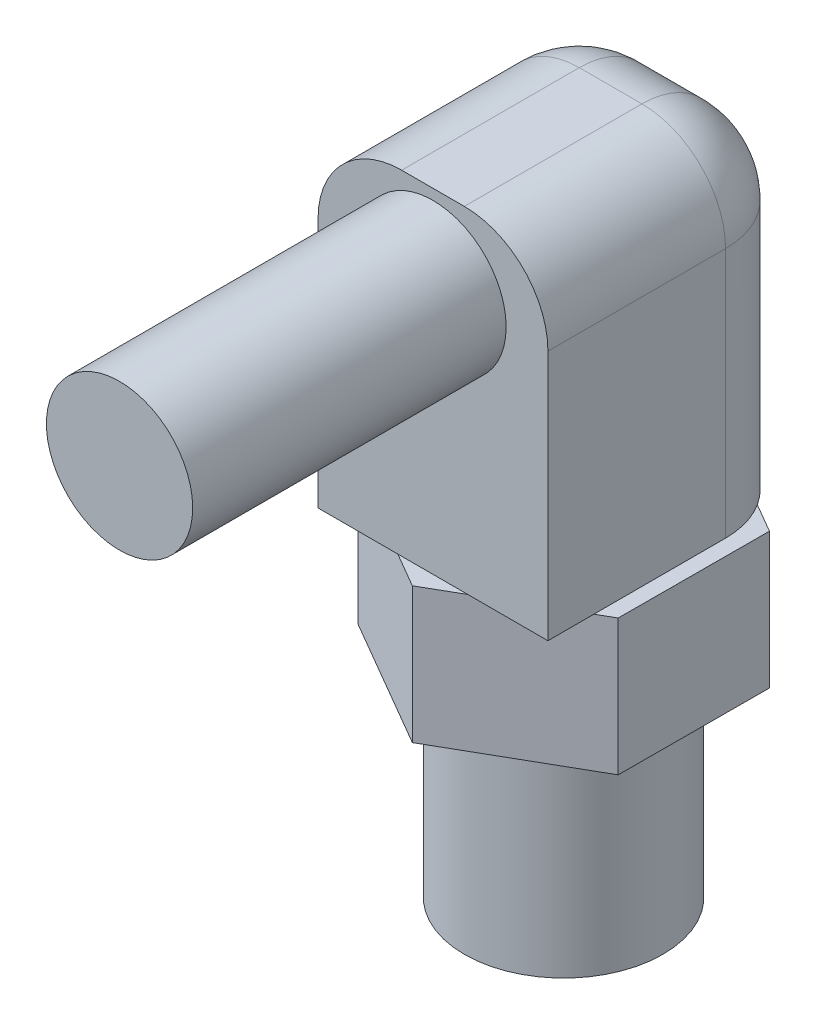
ISO-10303-21;
HEADER;
FILE_DESCRIPTION(('STEP AP214'),'2;1');
FILE_NAME('part.step','',(''),(''),'','','');
FILE_SCHEMA(('AUTOMOTIVE_DESIGN { 1 0 10303 214 1 1 1 1 }'));
ENDSEC;
DATA;
#1=APPLICATION_CONTEXT('core data for automotive mechanical design processes');
#2=APPLICATION_PROTOCOL_DEFINITION('international standard','automotive_design',2000,#1);
#3=PRODUCT_CONTEXT('',#1,'mechanical');
#4=PRODUCT('Part','Part','',(#3));
#5=PRODUCT_RELATED_PRODUCT_CATEGORY('part','',(#4));
#6=PRODUCT_DEFINITION_FORMATION('','',#4);
#7=PRODUCT_DEFINITION_CONTEXT('part definition',#1,'design');
#8=PRODUCT_DEFINITION('design','',#6,#7);
#9=PRODUCT_DEFINITION_SHAPE('','',#8);
#10=(LENGTH_UNIT() NAMED_UNIT(*) SI_UNIT(.MILLI.,.METRE.));
#11=(NAMED_UNIT(*) PLANE_ANGLE_UNIT() SI_UNIT($,.RADIAN.));
#12=(NAMED_UNIT(*) SI_UNIT($,.STERADIAN.) SOLID_ANGLE_UNIT());
#13=UNCERTAINTY_MEASURE_WITH_UNIT(LENGTH_MEASURE(1.E-05),#10,'distance_accuracy_value','');
#14=(GEOMETRIC_REPRESENTATION_CONTEXT(3) GLOBAL_UNCERTAINTY_ASSIGNED_CONTEXT((#13)) GLOBAL_UNIT_ASSIGNED_CONTEXT((#10,
#11,#12)) REPRESENTATION_CONTEXT('',''));
#15=CARTESIAN_POINT('',(0.,0.,0.));
#16=DIRECTION('',(0.,0.,1.));
#17=DIRECTION('',(1.,0.,0.));
#18=AXIS2_PLACEMENT_3D('',#15,#16,#17);
#19=CARTESIAN_POINT('',(-0.0105994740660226,-7.36600000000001,6.84115888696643));
#20=DIRECTION('',(0.,1.,0.));
#21=DIRECTION('',(0.,0.,1.));
#22=AXIS2_PLACEMENT_3D('',#19,#20,#21);
#23=PLANE('',#22);
#24=DIRECTION('',(-0.864576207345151,0.,-0.50250172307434));
#25=VECTOR('',#24,1.);
#26=CARTESIAN_POINT('',(-0.0105994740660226,-7.36600000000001,6.84115888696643));
#27=LINE('',#26,#25);
#28=CARTESIAN_POINT('',(-0.0105994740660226,-7.36600000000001,6.84115888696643));
#29=VERTEX_POINT('',#28);
#30=CARTESIAN_POINT('',(-3.18028646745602,-7.36600000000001,4.99890002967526));
#31=VERTEX_POINT('',#30);
#32=EDGE_CURVE('E169',#29,#31,#27,.T.);
#33=ORIENTED_EDGE('',*,*,#32,.T.);
#34=DIRECTION('',(0.00289115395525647,0.,-0.999995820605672));
#35=VECTOR('',#34,1.);
#36=CARTESIAN_POINT('',(-3.18028646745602,-7.36600000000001,4.99890002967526));
#37=LINE('',#36,#35);
#38=CARTESIAN_POINT('',(-3.16968699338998,-7.36600000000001,1.33274114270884));
#39=VERTEX_POINT('',#38);
#40=EDGE_CURVE('E158',#31,#39,#37,.T.);
#41=ORIENTED_EDGE('',*,*,#40,.T.);
#42=DIRECTION('',(0.867467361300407,0.,-0.497494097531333));
#43=VECTOR('',#42,1.);
#44=CARTESIAN_POINT('',(-3.16968699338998,-7.36600000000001,1.33274114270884));
#45=LINE('',#44,#43);
#46=CARTESIAN_POINT('',(0.0105994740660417,-7.36600000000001,-0.491158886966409));
#47=VERTEX_POINT('',#46);
#48=EDGE_CURVE('E168',#39,#47,#45,.T.);
#49=ORIENTED_EDGE('',*,*,#48,.T.);
#50=DIRECTION('',(0.864576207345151,0.,0.50250172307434));
#51=VECTOR('',#50,1.);
#52=CARTESIAN_POINT('',(0.0105994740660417,-7.36600000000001,-0.491158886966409));
#53=LINE('',#52,#51);
#54=CARTESIAN_POINT('',(3.18028646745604,-7.36600000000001,1.35109997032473));
#55=VERTEX_POINT('',#54);
#56=EDGE_CURVE('E579',#47,#55,#53,.T.);
#57=ORIENTED_EDGE('',*,*,#56,.T.);
#58=DIRECTION('',(-0.00289115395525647,0.,0.999995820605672));
#59=VECTOR('',#58,1.);
#60=CARTESIAN_POINT('',(3.18028646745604,-7.36600000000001,1.35109997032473));
#61=LINE('',#60,#59);
#62=CARTESIAN_POINT('',(3.16968699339,-7.36600000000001,5.01725885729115));
#63=VERTEX_POINT('',#62);
#64=EDGE_CURVE('E577',#55,#63,#61,.T.);
#65=ORIENTED_EDGE('',*,*,#64,.T.);
#66=DIRECTION('',(-0.867467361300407,0.,0.497494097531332));
#67=VECTOR('',#66,1.);
#68=CARTESIAN_POINT('',(3.16968699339,-7.36600000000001,5.01725885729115));
#69=LINE('',#68,#67);
#70=EDGE_CURVE('E174',#63,#29,#69,.T.);
#71=ORIENTED_EDGE('',*,*,#70,.T.);
#72=EDGE_LOOP('',(#33,#41,#49,#57,#65,#71));
#73=FACE_BOUND('',#72,.T.);
#74=CARTESIAN_POINT('',(0.,-7.36600000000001,3.17500000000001));
#75=DIRECTION('',(0.,1.,0.));
#76=DIRECTION('',(0.,0.,1.));
#77=AXIS2_PLACEMENT_3D('',#74,#75,#76);
#78=CIRCLE('',#77,2.413);
#79=CARTESIAN_POINT('',(0.,-7.36600000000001,5.58800000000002));
#80=VERTEX_POINT('',#79);
#81=EDGE_CURVE('E221',#80,#80,#78,.F.);
#82=ORIENTED_EDGE('',*,*,#81,.F.);
#83=EDGE_LOOP('',(#82));
#84=FACE_BOUND('',#83,.T.);
#85=ADVANCED_FACE('F32',(#73,#84),#23,.F.);
#86=CARTESIAN_POINT('',(-2.794,-4.06400000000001,6.34999999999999));
#87=DIRECTION('',(0.,1.,0.));
#88=DIRECTION('',(0.,0.,1.));
#89=AXIS2_PLACEMENT_3D('',#86,#87,#88);
#90=PLANE('',#89);
#91=DIRECTION('',(-0.864576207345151,0.,-0.50250172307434));
#92=VECTOR('',#91,1.);
#93=CARTESIAN_POINT('',(-0.0105994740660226,-4.06400000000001,6.84115888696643));
#94=LINE('',#93,#92);
#95=CARTESIAN_POINT('',(-0.855659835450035,-4.06400000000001,6.34999999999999));
#96=VERTEX_POINT('',#95);
#97=CARTESIAN_POINT('',(-2.794,-4.06400000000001,5.22341420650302));
#98=VERTEX_POINT('',#97);
#99=EDGE_CURVE('E225',#96,#98,#94,.T.);
#100=ORIENTED_EDGE('',*,*,#99,.F.);
#101=DIRECTION('',(1.,0.,0.));
#102=VECTOR('',#101,1.);
#103=CARTESIAN_POINT('',(-2.794,-4.06400000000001,6.34999999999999));
#104=LINE('',#103,#102);
#105=CARTESIAN_POINT('',(-2.794,-4.06400000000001,6.34999999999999));
#106=VERTEX_POINT('',#105);
#107=EDGE_CURVE('E207',#106,#96,#104,.T.);
#108=ORIENTED_EDGE('',*,*,#107,.F.);
#109=DIRECTION('',(0.,0.,-1.));
#110=VECTOR('',#109,1.);
#111=CARTESIAN_POINT('',(-2.794,-4.06400000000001,6.34999999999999));
#112=LINE('',#111,#110);
#113=EDGE_CURVE('E217',#106,#98,#112,.T.);
#114=ORIENTED_EDGE('',*,*,#113,.T.);
#115=EDGE_LOOP('',(#100,#108,#114));
#116=FACE_BOUND('',#115,.T.);
#117=ADVANCED_FACE('F380',(#116),#90,.F.);
#118=DIRECTION('',(-0.867467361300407,0.,0.497494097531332));
#119=VECTOR('',#118,1.);
#120=CARTESIAN_POINT('',(3.16968699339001,-4.06400000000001,5.01725885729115));
#121=LINE('',#120,#119);
#122=CARTESIAN_POINT('',(2.79400000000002,-4.06400000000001,5.23271602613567));
#123=VERTEX_POINT('',#122);
#124=CARTESIAN_POINT('',(0.845821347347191,-4.06400000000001,6.34999999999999));
#125=VERTEX_POINT('',#124);
#126=EDGE_CURVE('E336',#123,#125,#121,.T.);
#127=ORIENTED_EDGE('',*,*,#126,.F.);
#128=DIRECTION('',(0.,0.,-1.));
#129=VECTOR('',#128,1.);
#130=CARTESIAN_POINT('',(2.79400000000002,-4.06400000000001,6.34999999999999));
#131=LINE('',#130,#129);
#132=CARTESIAN_POINT('',(2.79400000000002,-4.06400000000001,6.34999999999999));
#133=VERTEX_POINT('',#132);
#134=EDGE_CURVE('E213',#133,#123,#131,.T.);
#135=ORIENTED_EDGE('',*,*,#134,.F.);
#136=EDGE_CURVE('E206',#125,#133,#104,.T.);
#137=ORIENTED_EDGE('',*,*,#136,.F.);
#138=EDGE_LOOP('',(#127,#135,#137));
#139=FACE_BOUND('',#138,.T.);
#140=ADVANCED_FACE('F334',(#139),#90,.F.);
#141=DIRECTION('',(0.864576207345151,0.,0.50250172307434));
#142=VECTOR('',#141,1.);
#143=CARTESIAN_POINT('',(0.0105994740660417,-4.06400000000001,-0.491158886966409));
#144=LINE('',#143,#142);
#145=CARTESIAN_POINT('',(0.859703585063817,-4.06400000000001,0.00235027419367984));
#146=VERTEX_POINT('',#145);
#147=CARTESIAN_POINT('',(2.47720512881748,-4.06400000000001,0.942460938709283));
#148=VERTEX_POINT('',#147);
#149=EDGE_CURVE('E356',#146,#148,#144,.T.);
#150=ORIENTED_EDGE('',*,*,#149,.F.);
#151=CARTESIAN_POINT('',(0.76200000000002,-4.06400000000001,2.03200000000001));
#152=DIRECTION('',(0.,1.,0.));
#153=DIRECTION('',(0.,0.,1.));
#154=AXIS2_PLACEMENT_3D('',#151,#152,#153);
#155=CIRCLE('',#154,2.032);
#156=EDGE_CURVE('E266',#146,#148,#155,.F.);
#157=ORIENTED_EDGE('',*,*,#156,.T.);
#158=EDGE_LOOP('',(#150,#157));
#159=FACE_BOUND('',#158,.T.);
#160=ADVANCED_FACE('F378',(#159),#90,.F.);
#161=DIRECTION('',(0.867467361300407,0.,-0.497494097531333));
#162=VECTOR('',#161,1.);
#163=CARTESIAN_POINT('',(-3.16968699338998,-4.06400000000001,1.33274114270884));
#164=LINE('',#163,#162);
#165=CARTESIAN_POINT('',(-2.4702750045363,-4.06400000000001,0.931627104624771));
#166=VERTEX_POINT('',#165);
#167=CARTESIAN_POINT('',(-0.849076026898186,-4.06400000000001,0.00186656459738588));
#168=VERTEX_POINT('',#167);
#169=EDGE_CURVE('E220',#166,#168,#164,.T.);
#170=ORIENTED_EDGE('',*,*,#169,.F.);
#171=CARTESIAN_POINT('',(-0.76199999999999,-4.06400000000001,2.03200000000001));
#172=DIRECTION('',(0.,1.,0.));
#173=DIRECTION('',(0.,0.,1.));
#174=AXIS2_PLACEMENT_3D('',#171,#172,#173);
#175=CIRCLE('',#174,2.032);
#176=EDGE_CURVE('E257',#166,#168,#175,.F.);
#177=ORIENTED_EDGE('',*,*,#176,.T.);
#178=EDGE_LOOP('',(#170,#177));
#179=FACE_BOUND('',#178,.T.);
#180=ADVANCED_FACE('F376',(#179),#90,.F.);
#181=CARTESIAN_POINT('',(2.79400000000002,-4.06400000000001,6.34999999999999));
#182=DIRECTION('',(0.,0.,1.));
#183=DIRECTION('',(1.,0.,0.));
#184=AXIS2_PLACEMENT_3D('',#181,#182,#183);
#185=PLANE('',#184);
#186=DIRECTION('',(-1.,0.,0.));
#187=VECTOR('',#186,1.);
#188=CARTESIAN_POINT('',(-2.794,4.06400000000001,6.34999999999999));
#189=LINE('',#188,#187);
#190=CARTESIAN_POINT('',(0.762000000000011,4.06400000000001,6.34999999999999));
#191=VERTEX_POINT('',#190);
#192=CARTESIAN_POINT('',(-0.761999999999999,4.06400000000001,6.34999999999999));
#193=VERTEX_POINT('',#192);
#194=EDGE_CURVE('E201',#191,#193,#189,.T.);
#195=ORIENTED_EDGE('',*,*,#194,.T.);
#196=CARTESIAN_POINT('',(-0.761999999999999,2.03200000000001,6.34999999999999));
#197=DIRECTION('',(0.,0.,1.));
#198=DIRECTION('',(1.,0.,0.));
#199=AXIS2_PLACEMENT_3D('',#196,#197,#198);
#200=CIRCLE('',#199,2.032);
#201=CARTESIAN_POINT('',(-2.794,2.03200000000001,6.34999999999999));
#202=VERTEX_POINT('',#201);
#203=EDGE_CURVE('E238',#193,#202,#200,.T.);
#204=ORIENTED_EDGE('',*,*,#203,.T.);
#205=DIRECTION('',(0.,-1.,0.));
#206=VECTOR('',#205,1.);
#207=CARTESIAN_POINT('',(-2.794,4.06400000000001,6.34999999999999));
#208=LINE('',#207,#206);
#209=EDGE_CURVE('E204',#202,#106,#208,.T.);
#210=ORIENTED_EDGE('',*,*,#209,.T.);
#211=ORIENTED_EDGE('',*,*,#107,.T.);
#212=EDGE_CURVE('E211',#96,#125,#104,.T.);
#213=ORIENTED_EDGE('',*,*,#212,.T.);
#214=ORIENTED_EDGE('',*,*,#136,.T.);
#215=DIRECTION('',(0.,1.,0.));
#216=VECTOR('',#215,1.);
#217=CARTESIAN_POINT('',(2.79400000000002,4.06400000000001,6.34999999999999));
#218=LINE('',#217,#216);
#219=CARTESIAN_POINT('',(2.79400000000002,2.03200000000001,6.34999999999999));
#220=VERTEX_POINT('',#219);
#221=EDGE_CURVE('E198',#133,#220,#218,.T.);
#222=ORIENTED_EDGE('',*,*,#221,.T.);
#223=CARTESIAN_POINT('',(0.76200000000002,2.03200000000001,6.34999999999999));
#224=DIRECTION('',(0.,0.,1.));
#225=DIRECTION('',(1.,0.,0.));
#226=AXIS2_PLACEMENT_3D('',#223,#224,#225);
#227=CIRCLE('',#226,2.032);
#228=EDGE_CURVE('E236',#220,#191,#227,.T.);
#229=ORIENTED_EDGE('',*,*,#228,.T.);
#230=EDGE_LOOP('',(#195,#204,#210,#211,#213,#214,#222,#229));
#231=FACE_BOUND('',#230,.T.);
#232=CARTESIAN_POINT('',(0.,2.03200000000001,6.34999999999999));
#233=DIRECTION('',(0.,0.,1.));
#234=DIRECTION('',(1.,0.,0.));
#235=AXIS2_PLACEMENT_3D('',#232,#233,#234);
#236=CIRCLE('',#235,1.778);
#237=CARTESIAN_POINT('',(1.77800000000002,2.03200000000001,6.34999999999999));
#238=VERTEX_POINT('',#237);
#239=EDGE_CURVE('E186',#238,#238,#236,.T.);
#240=ORIENTED_EDGE('',*,*,#239,.F.);
#241=EDGE_LOOP('',(#240));
#242=FACE_BOUND('',#241,.T.);
#243=ADVANCED_FACE('F315',(#231,#242),#185,.T.);
#244=CARTESIAN_POINT('',(2.79400000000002,4.06400000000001,6.34999999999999));
#245=DIRECTION('',(-1.,0.,0.));
#246=DIRECTION('',(0.,0.,1.));
#247=AXIS2_PLACEMENT_3D('',#244,#245,#246);
#248=PLANE('',#247);
#249=CARTESIAN_POINT('',(2.79400000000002,-4.06400000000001,2.03200000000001));
#250=VERTEX_POINT('',#249);
#251=EDGE_CURVE('E210',#123,#250,#131,.T.);
#252=ORIENTED_EDGE('',*,*,#251,.T.);
#253=DIRECTION('',(0.,1.,0.));
#254=VECTOR('',#253,1.);
#255=CARTESIAN_POINT('',(2.79400000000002,4.06400000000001,2.03200000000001));
#256=LINE('',#255,#254);
#257=CARTESIAN_POINT('',(2.79400000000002,2.03200000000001,2.03200000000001));
#258=VERTEX_POINT('',#257);
#259=EDGE_CURVE('E264',#250,#258,#256,.T.);
#260=ORIENTED_EDGE('',*,*,#259,.T.);
#261=DIRECTION('',(0.,0.,-1.));
#262=VECTOR('',#261,1.);
#263=CARTESIAN_POINT('',(2.79400000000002,2.03200000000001,6.34999999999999));
#264=LINE('',#263,#262);
#265=EDGE_CURVE('E243',#258,#220,#264,.F.);
#266=ORIENTED_EDGE('',*,*,#265,.T.);
#267=ORIENTED_EDGE('',*,*,#221,.F.);
#268=ORIENTED_EDGE('',*,*,#134,.T.);
#269=EDGE_LOOP('',(#252,#260,#266,#267,#268));
#270=FACE_BOUND('',#269,.T.);
#271=ADVANCED_FACE('F330',(#270),#248,.F.);
#272=CARTESIAN_POINT('',(-2.794,4.06400000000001,6.34999999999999));
#273=DIRECTION('',(0.,-1.,0.));
#274=DIRECTION('',(0.,0.,-1.));
#275=AXIS2_PLACEMENT_3D('',#272,#273,#274);
#276=PLANE('',#275);
#277=DIRECTION('',(-1.,0.,0.));
#278=VECTOR('',#277,1.);
#279=CARTESIAN_POINT('',(-2.794,4.06400000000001,2.03200000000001));
#280=LINE('',#279,#278);
#281=CARTESIAN_POINT('',(0.762000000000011,4.06400000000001,2.03200000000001));
#282=VERTEX_POINT('',#281);
#283=CARTESIAN_POINT('',(-0.761999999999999,4.06400000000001,2.03200000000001));
#284=VERTEX_POINT('',#283);
#285=EDGE_CURVE('E231',#282,#284,#280,.T.);
#286=ORIENTED_EDGE('',*,*,#285,.T.);
#287=DIRECTION('',(0.,0.,-1.));
#288=VECTOR('',#287,1.);
#289=CARTESIAN_POINT('',(-0.761999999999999,4.06400000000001,6.34999999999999));
#290=LINE('',#289,#288);
#291=EDGE_CURVE('E234',#284,#193,#290,.F.);
#292=ORIENTED_EDGE('',*,*,#291,.T.);
#293=ORIENTED_EDGE('',*,*,#194,.F.);
#294=DIRECTION('',(0.,0.,-1.));
#295=VECTOR('',#294,1.);
#296=CARTESIAN_POINT('',(0.762000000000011,4.06400000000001,6.34999999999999));
#297=LINE('',#296,#295);
#298=EDGE_CURVE('E228',#191,#282,#297,.T.);
#299=ORIENTED_EDGE('',*,*,#298,.T.);
#300=EDGE_LOOP('',(#286,#292,#293,#299));
#301=FACE_BOUND('',#300,.T.);
#302=ADVANCED_FACE('F323',(#301),#276,.F.);
#303=CARTESIAN_POINT('',(-2.794,4.06400000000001,6.34999999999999));
#304=DIRECTION('',(1.,0.,0.));
#305=DIRECTION('',(0.,0.,-1.));
#306=AXIS2_PLACEMENT_3D('',#303,#304,#305);
#307=PLANE('',#306);
#308=DIRECTION('',(0.,0.,-1.));
#309=VECTOR('',#308,1.);
#310=CARTESIAN_POINT('',(-2.794,2.03200000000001,6.34999999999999));
#311=LINE('',#310,#309);
#312=CARTESIAN_POINT('',(-2.794,2.03200000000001,2.03200000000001));
#313=VERTEX_POINT('',#312);
#314=EDGE_CURVE('E224',#202,#313,#311,.T.);
#315=ORIENTED_EDGE('',*,*,#314,.T.);
#316=DIRECTION('',(0.,-1.,0.));
#317=VECTOR('',#316,1.);
#318=CARTESIAN_POINT('',(-2.794,4.06400000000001,2.03200000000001));
#319=LINE('',#318,#317);
#320=CARTESIAN_POINT('',(-2.794,-4.06400000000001,2.03200000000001));
#321=VERTEX_POINT('',#320);
#322=EDGE_CURVE('E255',#313,#321,#319,.T.);
#323=ORIENTED_EDGE('',*,*,#322,.T.);
#324=EDGE_CURVE('E216',#98,#321,#112,.T.);
#325=ORIENTED_EDGE('',*,*,#324,.F.);
#326=ORIENTED_EDGE('',*,*,#113,.F.);
#327=ORIENTED_EDGE('',*,*,#209,.F.);
#328=EDGE_LOOP('',(#315,#323,#325,#326,#327));
#329=FACE_BOUND('',#328,.T.);
#330=ADVANCED_FACE('F311',(#329),#307,.F.);
#331=CARTESIAN_POINT('',(2.79400000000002,-4.06400000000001,0.));
#332=DIRECTION('',(0.,0.,1.));
#333=DIRECTION('',(1.,0.,0.));
#334=AXIS2_PLACEMENT_3D('',#331,#332,#333);
#335=PLANE('',#334);
#336=DIRECTION('',(1.,0.,0.));
#337=VECTOR('',#336,1.);
#338=CARTESIAN_POINT('',(-2.794,-4.06400000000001,0.));
#339=LINE('',#338,#337);
#340=CARTESIAN_POINT('',(-0.76199999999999,-4.06400000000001,0.));
#341=VERTEX_POINT('',#340);
#342=CARTESIAN_POINT('',(0.76200000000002,-4.06400000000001,0.));
#343=VERTEX_POINT('',#342);
#344=EDGE_CURVE('E196',#341,#343,#339,.T.);
#345=ORIENTED_EDGE('',*,*,#344,.F.);
#346=DIRECTION('',(0.,-1.,0.));
#347=VECTOR('',#346,1.);
#348=CARTESIAN_POINT('',(-0.76199999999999,-4.06400000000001,0.));
#349=LINE('',#348,#347);
#350=CARTESIAN_POINT('',(-0.761999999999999,2.03200000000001,0.));
#351=VERTEX_POINT('',#350);
#352=EDGE_CURVE('E262',#341,#351,#349,.F.);
#353=ORIENTED_EDGE('',*,*,#352,.T.);
#354=DIRECTION('',(-1.,0.,0.));
#355=VECTOR('',#354,1.);
#356=CARTESIAN_POINT('',(2.79400000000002,2.03200000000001,0.));
#357=LINE('',#356,#355);
#358=CARTESIAN_POINT('',(0.76200000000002,2.03200000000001,0.));
#359=VERTEX_POINT('',#358);
#360=EDGE_CURVE('E240',#351,#359,#357,.F.);
#361=ORIENTED_EDGE('',*,*,#360,.T.);
#362=DIRECTION('',(0.,1.,0.));
#363=VECTOR('',#362,1.);
#364=CARTESIAN_POINT('',(0.76200000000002,-4.06400000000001,0.));
#365=LINE('',#364,#363);
#366=EDGE_CURVE('E260',#359,#343,#365,.F.);
#367=ORIENTED_EDGE('',*,*,#366,.T.);
#368=EDGE_LOOP('',(#345,#353,#361,#367));
#369=FACE_BOUND('',#368,.T.);
#370=ADVANCED_FACE('F296',(#369),#335,.F.);
#371=CARTESIAN_POINT('',(0.,2.03200000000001,13.97));
#372=DIRECTION('',(0.,0.,-1.));
#373=DIRECTION('',(-1.,0.,0.));
#374=AXIS2_PLACEMENT_3D('',#371,#372,#373);
#375=CYLINDRICAL_SURFACE('',#374,1.778);
#376=CARTESIAN_POINT('',(0.,2.03200000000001,13.97));
#377=DIRECTION('',(0.,0.,1.));
#378=DIRECTION('',(1.,0.,0.));
#379=AXIS2_PLACEMENT_3D('',#376,#377,#378);
#380=CIRCLE('',#379,1.778);
#381=CARTESIAN_POINT('',(1.77800000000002,2.03200000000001,13.97));
#382=VERTEX_POINT('',#381);
#383=EDGE_CURVE('E189',#382,#382,#380,.T.);
#384=ORIENTED_EDGE('',*,*,#383,.F.);
#385=EDGE_LOOP('',(#384));
#386=FACE_BOUND('',#385,.T.);
#387=ORIENTED_EDGE('',*,*,#239,.T.);
#388=EDGE_LOOP('',(#387));
#389=FACE_BOUND('',#388,.T.);
#390=ADVANCED_FACE('F422',(#386,#389),#375,.T.);
#391=CARTESIAN_POINT('',(0.,2.03200000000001,13.97));
#392=DIRECTION('',(0.,0.,1.));
#393=DIRECTION('',(1.,0.,0.));
#394=AXIS2_PLACEMENT_3D('',#391,#392,#393);
#395=PLANE('',#394);
#396=ORIENTED_EDGE('',*,*,#383,.T.);
#397=EDGE_LOOP('',(#396));
#398=FACE_BOUND('',#397,.T.);
#399=ADVANCED_FACE('F419',(#398),#395,.T.);
#400=CARTESIAN_POINT('',(-0.0105994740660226,-4.06400000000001,6.84115888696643));
#401=DIRECTION('',(0.,1.,0.));
#402=DIRECTION('',(0.,0.,1.));
#403=AXIS2_PLACEMENT_3D('',#400,#401,#402);
#404=PLANE('',#403);
#405=ORIENTED_EDGE('',*,*,#251,.F.);
#406=CARTESIAN_POINT('',(3.16968699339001,-4.06400000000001,5.01725885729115));
#407=VERTEX_POINT('',#406);
#408=EDGE_CURVE('E178',#407,#123,#121,.T.);
#409=ORIENTED_EDGE('',*,*,#408,.F.);
#410=DIRECTION('',(-0.00289115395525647,0.,0.999995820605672));
#411=VECTOR('',#410,1.);
#412=CARTESIAN_POINT('',(3.18028646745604,-4.06400000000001,1.35109997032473));
#413=LINE('',#412,#411);
#414=CARTESIAN_POINT('',(3.18028646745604,-4.06400000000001,1.35109997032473));
#415=VERTEX_POINT('',#414);
#416=EDGE_CURVE('E349',#415,#407,#413,.T.);
#417=ORIENTED_EDGE('',*,*,#416,.F.);
#418=EDGE_CURVE('E48',#148,#415,#144,.T.);
#419=ORIENTED_EDGE('',*,*,#418,.F.);
#420=CARTESIAN_POINT('',(0.76200000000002,-4.06400000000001,2.03200000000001));
#421=DIRECTION('',(0.,1.,0.));
#422=DIRECTION('',(0.,0.,1.));
#423=AXIS2_PLACEMENT_3D('',#420,#421,#422);
#424=CIRCLE('',#423,2.032);
#425=EDGE_CURVE('E11',#148,#250,#424,.F.);
#426=ORIENTED_EDGE('',*,*,#425,.T.);
#427=EDGE_LOOP('',(#405,#409,#417,#419,#426));
#428=FACE_BOUND('',#427,.T.);
#429=ADVANCED_FACE('F340',(#428),#404,.T.);
#430=ORIENTED_EDGE('',*,*,#212,.F.);
#431=CARTESIAN_POINT('',(-0.0105994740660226,-4.06400000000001,6.84115888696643));
#432=VERTEX_POINT('',#431);
#433=EDGE_CURVE('E354',#432,#96,#94,.T.);
#434=ORIENTED_EDGE('',*,*,#433,.F.);
#435=EDGE_CURVE('E347',#125,#432,#121,.T.);
#436=ORIENTED_EDGE('',*,*,#435,.F.);
#437=EDGE_LOOP('',(#430,#434,#436));
#438=FACE_BOUND('',#437,.T.);
#439=ADVANCED_FACE('F521',(#438),#404,.T.);
#440=CARTESIAN_POINT('',(0.0105994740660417,-4.06400000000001,-0.491158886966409));
#441=VERTEX_POINT('',#440);
#442=EDGE_CURVE('E363',#168,#441,#164,.T.);
#443=ORIENTED_EDGE('',*,*,#442,.F.);
#444=CARTESIAN_POINT('',(-0.76199999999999,-4.06400000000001,2.03200000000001));
#445=DIRECTION('',(0.,1.,0.));
#446=DIRECTION('',(0.,0.,1.));
#447=AXIS2_PLACEMENT_3D('',#444,#445,#446);
#448=CIRCLE('',#447,2.032);
#449=EDGE_CURVE('E270',#168,#341,#448,.F.);
#450=ORIENTED_EDGE('',*,*,#449,.T.);
#451=ORIENTED_EDGE('',*,*,#344,.T.);
#452=CARTESIAN_POINT('',(0.76200000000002,-4.06400000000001,2.03200000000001));
#453=DIRECTION('',(0.,1.,0.));
#454=DIRECTION('',(0.,0.,1.));
#455=AXIS2_PLACEMENT_3D('',#452,#453,#454);
#456=CIRCLE('',#455,2.032);
#457=EDGE_CURVE('E41',#343,#146,#456,.F.);
#458=ORIENTED_EDGE('',*,*,#457,.T.);
#459=EDGE_CURVE('E352',#441,#146,#144,.T.);
#460=ORIENTED_EDGE('',*,*,#459,.F.);
#461=EDGE_LOOP('',(#443,#450,#451,#458,#460));
#462=FACE_BOUND('',#461,.T.);
#463=ADVANCED_FACE('F403',(#462),#404,.T.);
#464=CARTESIAN_POINT('',(-0.0105994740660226,-7.36600000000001,6.84115888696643));
#465=DIRECTION('',(0.50250172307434,0.,-0.864576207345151));
#466=DIRECTION('',(-0.864576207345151,0.,-0.50250172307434));
#467=AXIS2_PLACEMENT_3D('',#464,#465,#466);
#468=PLANE('',#467);
#469=ORIENTED_EDGE('',*,*,#433,.T.);
#470=ORIENTED_EDGE('',*,*,#99,.T.);
#471=CARTESIAN_POINT('',(-3.18028646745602,-4.06400000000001,4.99890002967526));
#472=VERTEX_POINT('',#471);
#473=EDGE_CURVE('E184',#98,#472,#94,.T.);
#474=ORIENTED_EDGE('',*,*,#473,.T.);
#475=DIRECTION('',(0.,1.,0.));
#476=VECTOR('',#475,1.);
#477=CARTESIAN_POINT('',(-3.18028646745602,-7.36600000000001,4.99890002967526));
#478=LINE('',#477,#476);
#479=EDGE_CURVE('E163',#31,#472,#478,.T.);
#480=ORIENTED_EDGE('',*,*,#479,.F.);
#481=ORIENTED_EDGE('',*,*,#32,.F.);
#482=DIRECTION('',(0.,1.,0.));
#483=VECTOR('',#482,1.);
#484=CARTESIAN_POINT('',(-0.0105994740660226,-7.36600000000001,6.84115888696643));
#485=LINE('',#484,#483);
#486=EDGE_CURVE('E574',#29,#432,#485,.T.);
#487=ORIENTED_EDGE('',*,*,#486,.T.);
#488=EDGE_LOOP('',(#469,#470,#474,#480,#481,#487));
#489=FACE_BOUND('',#488,.T.);
#490=ADVANCED_FACE('F181',(#489),#468,.F.);
#491=CARTESIAN_POINT('',(-3.18028646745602,-7.36600000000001,4.99890002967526));
#492=DIRECTION('',(0.999995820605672,0.,0.00289115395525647));
#493=DIRECTION('',(0.00289115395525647,0.,-0.999995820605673));
#494=AXIS2_PLACEMENT_3D('',#491,#492,#493);
#495=PLANE('',#494);
#496=DIRECTION('',(0.00289115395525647,0.,-0.999995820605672));
#497=VECTOR('',#496,1.);
#498=CARTESIAN_POINT('',(-3.18028646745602,-4.06400000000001,4.99890002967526));
#499=LINE('',#498,#497);
#500=CARTESIAN_POINT('',(-3.16968699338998,-4.06400000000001,1.33274114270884));
#501=VERTEX_POINT('',#500);
#502=EDGE_CURVE('E367',#472,#501,#499,.T.);
#503=ORIENTED_EDGE('',*,*,#502,.T.);
#504=DIRECTION('',(0.,1.,0.));
#505=VECTOR('',#504,1.);
#506=CARTESIAN_POINT('',(-3.16968699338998,-7.36600000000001,1.33274114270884));
#507=LINE('',#506,#505);
#508=EDGE_CURVE('E165',#39,#501,#507,.T.);
#509=ORIENTED_EDGE('',*,*,#508,.F.);
#510=ORIENTED_EDGE('',*,*,#40,.F.);
#511=ORIENTED_EDGE('',*,*,#479,.T.);
#512=EDGE_LOOP('',(#503,#509,#510,#511));
#513=FACE_BOUND('',#512,.T.);
#514=ADVANCED_FACE('F161',(#513),#495,.F.);
#515=CARTESIAN_POINT('',(-3.16968699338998,-7.36600000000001,1.33274114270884));
#516=DIRECTION('',(0.497494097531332,0.,0.867467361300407));
#517=DIRECTION('',(0.867467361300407,0.,-0.497494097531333));
#518=AXIS2_PLACEMENT_3D('',#515,#516,#517);
#519=PLANE('',#518);
#520=ORIENTED_EDGE('',*,*,#508,.T.);
#521=EDGE_CURVE('E361',#501,#166,#164,.T.);
#522=ORIENTED_EDGE('',*,*,#521,.T.);
#523=ORIENTED_EDGE('',*,*,#169,.T.);
#524=ORIENTED_EDGE('',*,*,#442,.T.);
#525=DIRECTION('',(0.,1.,0.));
#526=VECTOR('',#525,1.);
#527=CARTESIAN_POINT('',(0.0105994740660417,-7.36600000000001,-0.491158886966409));
#528=LINE('',#527,#526);
#529=EDGE_CURVE('E191',#47,#441,#528,.T.);
#530=ORIENTED_EDGE('',*,*,#529,.F.);
#531=ORIENTED_EDGE('',*,*,#48,.F.);
#532=EDGE_LOOP('',(#520,#522,#523,#524,#530,#531));
#533=FACE_BOUND('',#532,.T.);
#534=ADVANCED_FACE('F374',(#533),#519,.F.);
#535=CARTESIAN_POINT('',(0.0105994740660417,-7.36600000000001,-0.491158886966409));
#536=DIRECTION('',(-0.50250172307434,0.,0.864576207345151));
#537=DIRECTION('',(0.864576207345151,0.,0.50250172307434));
#538=AXIS2_PLACEMENT_3D('',#535,#536,#537);
#539=PLANE('',#538);
#540=ORIENTED_EDGE('',*,*,#529,.T.);
#541=ORIENTED_EDGE('',*,*,#459,.T.);
#542=ORIENTED_EDGE('',*,*,#149,.T.);
#543=ORIENTED_EDGE('',*,*,#418,.T.);
#544=DIRECTION('',(0.,1.,0.));
#545=VECTOR('',#544,1.);
#546=CARTESIAN_POINT('',(3.18028646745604,-7.36600000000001,1.35109997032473));
#547=LINE('',#546,#545);
#548=EDGE_CURVE('E582',#55,#415,#547,.T.);
#549=ORIENTED_EDGE('',*,*,#548,.F.);
#550=ORIENTED_EDGE('',*,*,#56,.F.);
#551=EDGE_LOOP('',(#540,#541,#542,#543,#549,#550));
#552=FACE_BOUND('',#551,.T.);
#553=ADVANCED_FACE('F409',(#552),#539,.F.);
#554=CARTESIAN_POINT('',(3.18028646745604,-7.36600000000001,1.35109997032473));
#555=DIRECTION('',(-0.999995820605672,0.,-0.00289115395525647));
#556=DIRECTION('',(-0.00289115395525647,0.,0.999995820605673));
#557=AXIS2_PLACEMENT_3D('',#554,#555,#556);
#558=PLANE('',#557);
#559=ORIENTED_EDGE('',*,*,#416,.T.);
#560=DIRECTION('',(0.,1.,0.));
#561=VECTOR('',#560,1.);
#562=CARTESIAN_POINT('',(3.16968699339,-7.36600000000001,5.01725885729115));
#563=LINE('',#562,#561);
#564=EDGE_CURVE('E346',#63,#407,#563,.T.);
#565=ORIENTED_EDGE('',*,*,#564,.F.);
#566=ORIENTED_EDGE('',*,*,#64,.F.);
#567=ORIENTED_EDGE('',*,*,#548,.T.);
#568=EDGE_LOOP('',(#559,#565,#566,#567));
#569=FACE_BOUND('',#568,.T.);
#570=ADVANCED_FACE('F406',(#569),#558,.F.);
#571=CARTESIAN_POINT('',(3.16968699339,-7.36600000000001,5.01725885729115));
#572=DIRECTION('',(-0.497494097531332,0.,-0.867467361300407));
#573=DIRECTION('',(-0.867467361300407,0.,0.497494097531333));
#574=AXIS2_PLACEMENT_3D('',#571,#572,#573);
#575=PLANE('',#574);
#576=ORIENTED_EDGE('',*,*,#408,.T.);
#577=ORIENTED_EDGE('',*,*,#126,.T.);
#578=ORIENTED_EDGE('',*,*,#435,.T.);
#579=ORIENTED_EDGE('',*,*,#486,.F.);
#580=ORIENTED_EDGE('',*,*,#70,.F.);
#581=ORIENTED_EDGE('',*,*,#564,.T.);
#582=EDGE_LOOP('',(#576,#577,#578,#579,#580,#581));
#583=FACE_BOUND('',#582,.T.);
#584=ADVANCED_FACE('F344',(#583),#575,.F.);
#585=ORIENTED_EDGE('',*,*,#473,.F.);
#586=ORIENTED_EDGE('',*,*,#324,.T.);
#587=CARTESIAN_POINT('',(-0.76199999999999,-4.06400000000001,2.03200000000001));
#588=DIRECTION('',(0.,1.,0.));
#589=DIRECTION('',(0.,0.,1.));
#590=AXIS2_PLACEMENT_3D('',#587,#588,#589);
#591=CIRCLE('',#590,2.032);
#592=EDGE_CURVE('E268',#321,#166,#591,.F.);
#593=ORIENTED_EDGE('',*,*,#592,.T.);
#594=ORIENTED_EDGE('',*,*,#521,.F.);
#595=ORIENTED_EDGE('',*,*,#502,.F.);
#596=EDGE_LOOP('',(#585,#586,#593,#594,#595));
#597=FACE_BOUND('',#596,.T.);
#598=ADVANCED_FACE('F399',(#597),#404,.T.);
#599=CARTESIAN_POINT('',(0.,-12.446,3.17500000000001));
#600=DIRECTION('',(0.,1.,0.));
#601=DIRECTION('',(0.,0.,1.));
#602=AXIS2_PLACEMENT_3D('',#599,#600,#601);
#603=CYLINDRICAL_SURFACE('',#602,2.413);
#604=CARTESIAN_POINT('',(0.,-12.446,3.17500000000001));
#605=DIRECTION('',(0.,-1.,0.));
#606=DIRECTION('',(0.,0.,-1.));
#607=AXIS2_PLACEMENT_3D('',#604,#605,#606);
#608=CIRCLE('',#607,2.413);
#609=CARTESIAN_POINT('',(0.,-12.446,0.762000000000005));
#610=VERTEX_POINT('',#609);
#611=EDGE_CURVE('E273',#610,#610,#608,.T.);
#612=ORIENTED_EDGE('',*,*,#611,.F.);
#613=EDGE_LOOP('',(#612));
#614=FACE_BOUND('',#613,.T.);
#615=ORIENTED_EDGE('',*,*,#81,.T.);
#616=EDGE_LOOP('',(#615));
#617=FACE_BOUND('',#616,.T.);
#618=ADVANCED_FACE('F397',(#614,#617),#603,.T.);
#619=CARTESIAN_POINT('',(0.,-12.446,3.17500000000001));
#620=DIRECTION('',(0.,-1.,0.));
#621=DIRECTION('',(0.,0.,-1.));
#622=AXIS2_PLACEMENT_3D('',#619,#620,#621);
#623=PLANE('',#622);
#624=ORIENTED_EDGE('',*,*,#611,.T.);
#625=EDGE_LOOP('',(#624));
#626=FACE_BOUND('',#625,.T.);
#627=ADVANCED_FACE('F443',(#626),#623,.T.);
#628=CARTESIAN_POINT('',(0.76200000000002,2.03200000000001,6.34999999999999));
#629=DIRECTION('',(0.,0.,-1.));
#630=DIRECTION('',(-1.,0.,0.));
#631=AXIS2_PLACEMENT_3D('',#628,#629,#630);
#632=CYLINDRICAL_SURFACE('',#631,2.032);
#633=ORIENTED_EDGE('',*,*,#265,.F.);
#634=CARTESIAN_POINT('',(0.76200000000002,2.03200000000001,2.03200000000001));
#635=DIRECTION('',(0.,0.,-1.));
#636=DIRECTION('',(-1.,0.,0.));
#637=AXIS2_PLACEMENT_3D('',#634,#635,#636);
#638=CIRCLE('',#637,2.032);
#639=EDGE_CURVE('E253',#258,#282,#638,.F.);
#640=ORIENTED_EDGE('',*,*,#639,.T.);
#641=ORIENTED_EDGE('',*,*,#298,.F.);
#642=ORIENTED_EDGE('',*,*,#228,.F.);
#643=EDGE_LOOP('',(#633,#640,#641,#642));
#644=FACE_BOUND('',#643,.T.);
#645=ADVANCED_FACE('F326',(#644),#632,.T.);
#646=CARTESIAN_POINT('',(-2.794,2.03200000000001,2.03200000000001));
#647=DIRECTION('',(-1.,0.,0.));
#648=DIRECTION('',(0.,0.,1.));
#649=AXIS2_PLACEMENT_3D('',#646,#647,#648);
#650=CYLINDRICAL_SURFACE('',#649,2.032);
#651=ORIENTED_EDGE('',*,*,#360,.F.);
#652=CARTESIAN_POINT('',(-0.761999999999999,2.03200000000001,2.03200000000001));
#653=DIRECTION('',(-1.,0.,0.));
#654=DIRECTION('',(0.,0.,1.));
#655=AXIS2_PLACEMENT_3D('',#652,#653,#654);
#656=CIRCLE('',#655,2.032);
#657=EDGE_CURVE('E251',#351,#284,#656,.F.);
#658=ORIENTED_EDGE('',*,*,#657,.T.);
#659=ORIENTED_EDGE('',*,*,#285,.F.);
#660=CARTESIAN_POINT('',(0.76200000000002,2.03200000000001,2.03200000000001));
#661=DIRECTION('',(-1.,0.,0.));
#662=DIRECTION('',(0.,0.,1.));
#663=AXIS2_PLACEMENT_3D('',#660,#661,#662);
#664=CIRCLE('',#663,2.032);
#665=EDGE_CURVE('E248',#282,#359,#664,.T.);
#666=ORIENTED_EDGE('',*,*,#665,.T.);
#667=EDGE_LOOP('',(#651,#658,#659,#666));
#668=FACE_BOUND('',#667,.T.);
#669=ADVANCED_FACE('F295',(#668),#650,.T.);
#670=CARTESIAN_POINT('',(-0.761999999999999,2.03200000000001,6.34999999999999));
#671=DIRECTION('',(0.,0.,-1.));
#672=DIRECTION('',(-1.,0.,0.));
#673=AXIS2_PLACEMENT_3D('',#670,#671,#672);
#674=CYLINDRICAL_SURFACE('',#673,2.032);
#675=ORIENTED_EDGE('',*,*,#291,.F.);
#676=CARTESIAN_POINT('',(-0.761999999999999,2.03200000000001,2.03200000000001));
#677=DIRECTION('',(0.,0.,-1.));
#678=DIRECTION('',(-1.,0.,0.));
#679=AXIS2_PLACEMENT_3D('',#676,#677,#678);
#680=CIRCLE('',#679,2.032);
#681=EDGE_CURVE('E245',#284,#313,#680,.F.);
#682=ORIENTED_EDGE('',*,*,#681,.T.);
#683=ORIENTED_EDGE('',*,*,#314,.F.);
#684=ORIENTED_EDGE('',*,*,#203,.F.);
#685=EDGE_LOOP('',(#675,#682,#683,#684));
#686=FACE_BOUND('',#685,.T.);
#687=ADVANCED_FACE('F308',(#686),#674,.T.);
#688=CARTESIAN_POINT('',(-0.761999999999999,4.06400000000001,2.03200000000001));
#689=DIRECTION('',(0.,-1.,0.));
#690=DIRECTION('',(0.,0.,-1.));
#691=AXIS2_PLACEMENT_3D('',#688,#689,#690);
#692=CYLINDRICAL_SURFACE('',#691,2.032);
#693=ORIENTED_EDGE('',*,*,#592,.F.);
#694=ORIENTED_EDGE('',*,*,#322,.F.);
#695=CARTESIAN_POINT('',(-0.761999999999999,2.03200000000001,2.03200000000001));
#696=DIRECTION('',(0.,1.,0.));
#697=DIRECTION('',(0.,0.,1.));
#698=AXIS2_PLACEMENT_3D('',#695,#696,#697);
#699=CIRCLE('',#698,2.032);
#700=EDGE_CURVE('E272',#351,#313,#699,.T.);
#701=ORIENTED_EDGE('',*,*,#700,.F.);
#702=ORIENTED_EDGE('',*,*,#352,.F.);
#703=ORIENTED_EDGE('',*,*,#449,.F.);
#704=ORIENTED_EDGE('',*,*,#176,.F.);
#705=EDGE_LOOP('',(#693,#694,#701,#702,#703,#704));
#706=FACE_BOUND('',#705,.T.);
#707=ADVANCED_FACE('F301',(#706),#692,.T.);
#708=CARTESIAN_POINT('',(-0.761999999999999,2.03200000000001,2.03200000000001));
#709=DIRECTION('',(0.,0.,1.));
#710=DIRECTION('',(1.,0.,0.));
#711=AXIS2_PLACEMENT_3D('',#708,#709,#710);
#712=SPHERICAL_SURFACE('',#711,2.032);
#713=ORIENTED_EDGE('',*,*,#681,.F.);
#714=ORIENTED_EDGE('',*,*,#657,.F.);
#715=ORIENTED_EDGE('',*,*,#700,.T.);
#716=EDGE_LOOP('',(#713,#714,#715));
#717=FACE_BOUND('',#716,.T.);
#718=ADVANCED_FACE('F444',(#717),#712,.T.);
#719=CARTESIAN_POINT('',(0.762000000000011,4.06400000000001,2.03200000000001));
#720=DIRECTION('',(0.,1.,0.));
#721=DIRECTION('',(0.,0.,1.));
#722=AXIS2_PLACEMENT_3D('',#719,#720,#721);
#723=CYLINDRICAL_SURFACE('',#722,2.032);
#724=ORIENTED_EDGE('',*,*,#457,.F.);
#725=ORIENTED_EDGE('',*,*,#366,.F.);
#726=CARTESIAN_POINT('',(0.76200000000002,2.03200000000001,2.03200000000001));
#727=DIRECTION('',(0.,1.,0.));
#728=DIRECTION('',(0.,0.,1.));
#729=AXIS2_PLACEMENT_3D('',#726,#727,#728);
#730=CIRCLE('',#729,2.032);
#731=EDGE_CURVE('E36',#258,#359,#730,.T.);
#732=ORIENTED_EDGE('',*,*,#731,.F.);
#733=ORIENTED_EDGE('',*,*,#259,.F.);
#734=ORIENTED_EDGE('',*,*,#425,.F.);
#735=ORIENTED_EDGE('',*,*,#156,.F.);
#736=EDGE_LOOP('',(#724,#725,#732,#733,#734,#735));
#737=FACE_BOUND('',#736,.T.);
#738=ADVANCED_FACE('F34',(#737),#723,.T.);
#739=CARTESIAN_POINT('',(0.76200000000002,2.03200000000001,2.03200000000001));
#740=DIRECTION('',(0.,0.,1.));
#741=DIRECTION('',(1.,0.,0.));
#742=AXIS2_PLACEMENT_3D('',#739,#740,#741);
#743=SPHERICAL_SURFACE('',#742,2.032);
#744=ORIENTED_EDGE('',*,*,#665,.F.);
#745=ORIENTED_EDGE('',*,*,#639,.F.);
#746=ORIENTED_EDGE('',*,*,#731,.T.);
#747=EDGE_LOOP('',(#744,#745,#746));
#748=FACE_BOUND('',#747,.T.);
#749=ADVANCED_FACE('F286',(#748),#743,.T.);
#750=CLOSED_SHELL('',(#85,#117,#140,#160,#180,#243,#271,#302,#330,#370,#390,#399,#429,#439,#463,
#490,#514,#534,#553,#570,#584,#598,#618,#627,#645,#669,#687,#707,#718,#738,#749));
#751=MANIFOLD_SOLID_BREP('B2',#750);
#752=ADVANCED_BREP_SHAPE_REPRESENTATION('',(#18,#751),#14);
#753=SHAPE_DEFINITION_REPRESENTATION(#9,#752);
ENDSEC;
END-ISO-10303-21;
